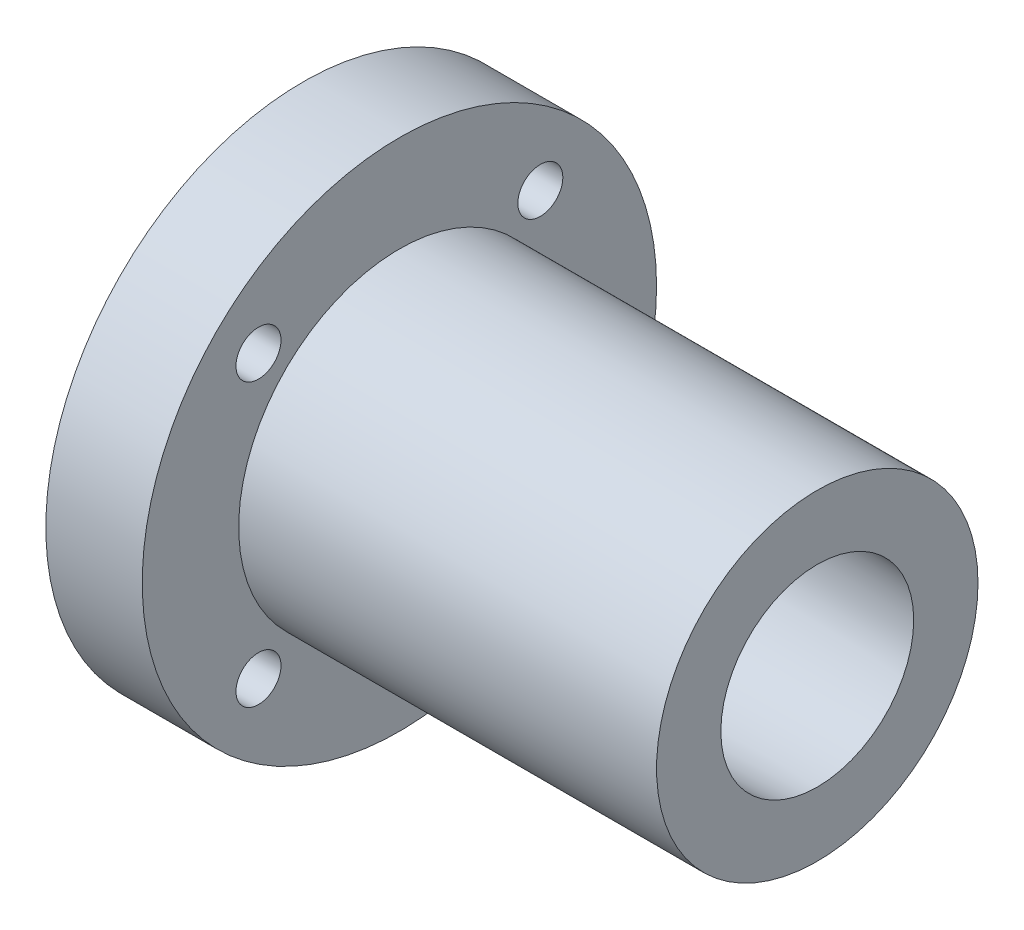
from build123d import *

# Parameters (mm, degrees)
HOLE_WIZARD_7_0_7_1_D    = 7
PATTERN_CIRCULAR_1_COUNT = 4


with BuildPart() as part:
    # Sketch 1 → Revolve 2 (revolve)
    with BuildSketch(Plane.XY, mode=Mode.PRIVATE) as revolve_2_sk:
        Polygon((0, 0), (80, 0), (80, 25), (15, 25), (15, 40), (0, 40), align=None)
    revolve(revolve_2_sk.sketch.rotate(Axis((0, 0, 0), (-1, 0, 0)), 90), axis=Axis((0, 0, 0), (-1, 0, 0)))

    # Sketch 2 → Cut-Revolve 1 (revolve, cut)
    with BuildSketch(Plane.XY, mode=Mode.PRIVATE) as cut_revolve_1_sk:
        Polygon((0, 0), (80, 0), (80, 15), (0, 18), align=None)
    revolve(cut_revolve_1_sk.sketch.rotate(Axis((0, 0, 0), (-1, 0, 0)), 90), axis=Axis((0, 0, 0), (-1, 0, 0)), mode=Mode.SUBTRACT)

    # Hole Wizard 7.0 _7_ _1 (through all)
    with Locations(Plane.ZY):
        with Locations((-21.920310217, 21.920310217)):
            hole_wizard_7_0_7_1 = Hole(HOLE_WIZARD_7_0_7_1_D / 2)

    # Pattern Circular 1: Hole Wizard 7.0 _7_ _1 ×4 about axis
    pattern_circular_1_axis = Axis((0, 0, 0), (1, 0, 0))
    for i in range(1, PATTERN_CIRCULAR_1_COUNT):
        add(hole_wizard_7_0_7_1.rotate(pattern_circular_1_axis, i * 360 / PATTERN_CIRCULAR_1_COUNT), mode=Mode.SUBTRACT)


solid = part.part
